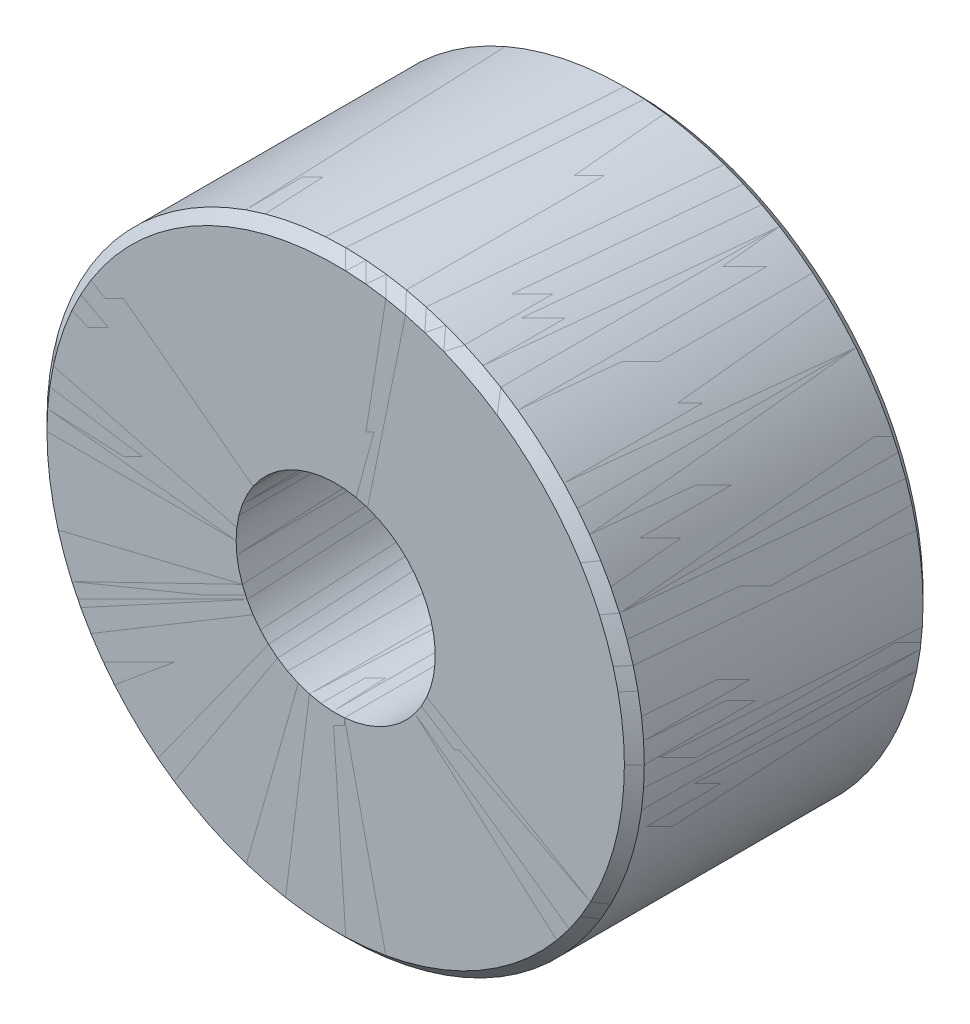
ISO-10303-21;
HEADER;
FILE_DESCRIPTION(('STEP AP214'),'2;1');
FILE_NAME('part.step','',(''),(''),'','','');
FILE_SCHEMA(('AUTOMOTIVE_DESIGN { 1 0 10303 214 1 1 1 1 }'));
ENDSEC;
DATA;
#1=APPLICATION_CONTEXT('core data for automotive mechanical design processes');
#2=APPLICATION_PROTOCOL_DEFINITION('international standard','automotive_design',2000,#1);
#3=PRODUCT_CONTEXT('',#1,'mechanical');
#4=PRODUCT('Part','Part','',(#3));
#5=PRODUCT_RELATED_PRODUCT_CATEGORY('part','',(#4));
#6=PRODUCT_DEFINITION_FORMATION('','',#4);
#7=PRODUCT_DEFINITION_CONTEXT('part definition',#1,'design');
#8=PRODUCT_DEFINITION('design','',#6,#7);
#9=PRODUCT_DEFINITION_SHAPE('','',#8);
#10=(LENGTH_UNIT() NAMED_UNIT(*) SI_UNIT(.MILLI.,.METRE.));
#11=(NAMED_UNIT(*) PLANE_ANGLE_UNIT() SI_UNIT($,.RADIAN.));
#12=(NAMED_UNIT(*) SI_UNIT($,.STERADIAN.) SOLID_ANGLE_UNIT());
#13=UNCERTAINTY_MEASURE_WITH_UNIT(LENGTH_MEASURE(1.E-05),#10,'distance_accuracy_value','');
#14=(GEOMETRIC_REPRESENTATION_CONTEXT(3) GLOBAL_UNCERTAINTY_ASSIGNED_CONTEXT((#13)) GLOBAL_UNIT_ASSIGNED_CONTEXT((#10,
#11,#12)) REPRESENTATION_CONTEXT('',''));
#15=CARTESIAN_POINT('',(0.,0.,0.));
#16=DIRECTION('',(0.,0.,1.));
#17=DIRECTION('',(1.,0.,0.));
#18=AXIS2_PLACEMENT_3D('',#15,#16,#17);
#19=CARTESIAN_POINT('',(0.,0.,-14.5));
#20=DIRECTION('',(0.,0.,1.));
#21=DIRECTION('',(1.,0.,0.));
#22=AXIS2_PLACEMENT_3D('',#19,#20,#21);
#23=CYLINDRICAL_SURFACE('',#22,15.);
#24=CARTESIAN_POINT('',(0.,0.,-14.5));
#25=DIRECTION('',(0.,0.,1.));
#26=DIRECTION('',(1.,0.,0.));
#27=AXIS2_PLACEMENT_3D('',#24,#25,#26);
#28=CIRCLE('',#27,15.);
#29=CARTESIAN_POINT('',(15.,0.,-14.5));
#30=VERTEX_POINT('',#29);
#31=EDGE_CURVE('P0_E362',#30,#30,#28,.T.);
#32=ORIENTED_EDGE('',*,*,#31,.T.);
#33=EDGE_LOOP('',(#32));
#34=FACE_BOUND('',#33,.T.);
#35=CARTESIAN_POINT('',(0.,0.,-0.5));
#36=DIRECTION('',(0.,0.,1.));
#37=DIRECTION('',(1.,0.,0.));
#38=AXIS2_PLACEMENT_3D('',#35,#36,#37);
#39=CIRCLE('',#38,15.);
#40=CARTESIAN_POINT('',(15.,0.,-0.5));
#41=VERTEX_POINT('',#40);
#42=EDGE_CURVE('P0_E371',#41,#41,#39,.F.);
#43=ORIENTED_EDGE('',*,*,#42,.T.);
#44=EDGE_LOOP('',(#43));
#45=FACE_BOUND('',#44,.T.);
#46=ADVANCED_FACE('P0_F346',(#34,#45),#23,.T.);
#47=CARTESIAN_POINT('',(0.,0.,-0.5));
#48=DIRECTION('',(0.,0.,-1.));
#49=DIRECTION('',(-1.,0.,0.));
#50=AXIS2_PLACEMENT_3D('',#47,#48,#49);
#51=CONICAL_SURFACE('',#50,15.,0.785398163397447);
#52=ORIENTED_EDGE('',*,*,#42,.F.);
#53=EDGE_LOOP('',(#52));
#54=FACE_BOUND('',#53,.T.);
#55=CARTESIAN_POINT('',(0.,0.,0.));
#56=DIRECTION('',(0.,0.,-1.));
#57=DIRECTION('',(-1.,0.,0.));
#58=AXIS2_PLACEMENT_3D('',#55,#56,#57);
#59=CIRCLE('',#58,14.5);
#60=CARTESIAN_POINT('',(-14.5,0.,0.));
#61=VERTEX_POINT('',#60);
#62=EDGE_CURVE('P0_E350',#61,#61,#59,.F.);
#63=ORIENTED_EDGE('',*,*,#62,.F.);
#64=EDGE_LOOP('',(#63));
#65=FACE_BOUND('',#64,.T.);
#66=ADVANCED_FACE('P0_F378',(#54,#65),#51,.T.);
#67=CARTESIAN_POINT('',(0.,0.,-15.));
#68=DIRECTION('',(0.,0.,1.));
#69=DIRECTION('',(0.,-1.,0.));
#70=AXIS2_PLACEMENT_3D('',#67,#68,#69);
#71=CONICAL_SURFACE('',#70,14.5,0.785398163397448);
#72=CARTESIAN_POINT('',(0.,0.,-15.));
#73=DIRECTION('',(0.,0.,1.));
#74=DIRECTION('',(0.,-1.,0.));
#75=AXIS2_PLACEMENT_3D('',#72,#73,#74);
#76=CIRCLE('',#75,14.5);
#77=CARTESIAN_POINT('',(0.,-14.5,-15.));
#78=VERTEX_POINT('',#77);
#79=EDGE_CURVE('P0_E359',#78,#78,#76,.F.);
#80=ORIENTED_EDGE('',*,*,#79,.F.);
#81=EDGE_LOOP('',(#80));
#82=FACE_BOUND('',#81,.T.);
#83=ORIENTED_EDGE('',*,*,#31,.F.);
#84=EDGE_LOOP('',(#83));
#85=FACE_BOUND('',#84,.T.);
#86=ADVANCED_FACE('P0_F381',(#82,#85),#71,.T.);
#87=CARTESIAN_POINT('',(-14.5,-14.5,0.));
#88=DIRECTION('',(0.,0.,1.));
#89=DIRECTION('',(1.,0.,0.));
#90=AXIS2_PLACEMENT_3D('',#87,#88,#89);
#91=PLANE('',#90);
#92=CARTESIAN_POINT('',(0.,0.,0.));
#93=DIRECTION('',(0.,0.,-1.));
#94=DIRECTION('',(-1.,0.,0.));
#95=AXIS2_PLACEMENT_3D('',#92,#93,#94);
#96=CIRCLE('',#95,5.);
#97=CARTESIAN_POINT('',(-5.,0.,0.));
#98=VERTEX_POINT('',#97);
#99=EDGE_CURVE('P0_E354',#98,#98,#96,.F.);
#100=ORIENTED_EDGE('',*,*,#99,.F.);
#101=EDGE_LOOP('',(#100));
#102=FACE_BOUND('',#101,.T.);
#103=ORIENTED_EDGE('',*,*,#62,.T.);
#104=EDGE_LOOP('',(#103));
#105=FACE_BOUND('',#104,.T.);
#106=ADVANCED_FACE('P0_F387',(#102,#105),#91,.T.);
#107=CARTESIAN_POINT('',(14.5,-14.5,-15.));
#108=DIRECTION('',(0.,0.,-1.));
#109=DIRECTION('',(-1.,0.,0.));
#110=AXIS2_PLACEMENT_3D('',#107,#108,#109);
#111=PLANE('',#110);
#112=CARTESIAN_POINT('',(0.,0.,-15.));
#113=DIRECTION('',(0.,0.,-1.));
#114=DIRECTION('',(-1.,0.,0.));
#115=AXIS2_PLACEMENT_3D('',#112,#113,#114);
#116=CIRCLE('',#115,5.);
#117=CARTESIAN_POINT('',(-5.,0.,-15.));
#118=VERTEX_POINT('',#117);
#119=EDGE_CURVE('P0_E10',#118,#118,#116,.T.);
#120=ORIENTED_EDGE('',*,*,#119,.F.);
#121=EDGE_LOOP('',(#120));
#122=FACE_BOUND('',#121,.T.);
#123=ORIENTED_EDGE('',*,*,#79,.T.);
#124=EDGE_LOOP('',(#123));
#125=FACE_BOUND('',#124,.T.);
#126=ADVANCED_FACE('P0_F348',(#122,#125),#111,.T.);
#127=CARTESIAN_POINT('',(0.,0.,0.));
#128=DIRECTION('',(0.,0.,-1.));
#129=DIRECTION('',(-1.,0.,0.));
#130=AXIS2_PLACEMENT_3D('',#127,#128,#129);
#131=CYLINDRICAL_SURFACE('',#130,5.);
#132=ORIENTED_EDGE('',*,*,#119,.T.);
#133=EDGE_LOOP('',(#132));
#134=FACE_BOUND('',#133,.T.);
#135=ORIENTED_EDGE('',*,*,#99,.T.);
#136=EDGE_LOOP('',(#135));
#137=FACE_BOUND('',#136,.T.);
#138=ADVANCED_FACE('P0_F392',(#134,#137),#131,.F.);
#139=CLOSED_SHELL('',(#46,#66,#86,#106,#126,#138));
#140=MANIFOLD_SOLID_BREP('P0_B2',#139);
#141=CARTESIAN_POINT('',(0.,0.,-14.5));
#142=DIRECTION('',(0.,0.,1.));
#143=DIRECTION('',(1.,0.,0.));
#144=AXIS2_PLACEMENT_3D('',#141,#142,#143);
#145=CYLINDRICAL_SURFACE('',#144,15.);
#146=CARTESIAN_POINT('',(0.,0.,-14.5));
#147=DIRECTION('',(0.,0.,1.));
#148=DIRECTION('',(1.,0.,0.));
#149=AXIS2_PLACEMENT_3D('',#146,#147,#148);
#150=CIRCLE('',#149,15.);
#151=CARTESIAN_POINT('',(15.,0.,-14.5));
#152=VERTEX_POINT('',#151);
#153=EDGE_CURVE('P1_E29',#152,#152,#150,.T.);
#154=ORIENTED_EDGE('',*,*,#153,.T.);
#155=EDGE_LOOP('',(#154));
#156=FACE_BOUND('',#155,.T.);
#157=CARTESIAN_POINT('',(0.,0.,-0.5));
#158=DIRECTION('',(0.,0.,1.));
#159=DIRECTION('',(1.,0.,0.));
#160=AXIS2_PLACEMENT_3D('',#157,#158,#159);
#161=CIRCLE('',#160,15.);
#162=CARTESIAN_POINT('',(15.,0.,-0.5));
#163=VERTEX_POINT('',#162);
#164=EDGE_CURVE('P1_E38',#163,#163,#161,.F.);
#165=ORIENTED_EDGE('',*,*,#164,.T.);
#166=EDGE_LOOP('',(#165));
#167=FACE_BOUND('',#166,.T.);
#168=ADVANCED_FACE('P1_F13',(#156,#167),#145,.T.);
#169=CARTESIAN_POINT('',(0.,0.,-0.5));
#170=DIRECTION('',(0.,0.,-1.));
#171=DIRECTION('',(-1.,0.,0.));
#172=AXIS2_PLACEMENT_3D('',#169,#170,#171);
#173=CONICAL_SURFACE('',#172,15.,0.785398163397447);
#174=ORIENTED_EDGE('',*,*,#164,.F.);
#175=EDGE_LOOP('',(#174));
#176=FACE_BOUND('',#175,.T.);
#177=CARTESIAN_POINT('',(0.,0.,0.));
#178=DIRECTION('',(0.,0.,-1.));
#179=DIRECTION('',(-1.,0.,0.));
#180=AXIS2_PLACEMENT_3D('',#177,#178,#179);
#181=CIRCLE('',#180,14.5);
#182=CARTESIAN_POINT('',(-14.5,0.,0.));
#183=VERTEX_POINT('',#182);
#184=EDGE_CURVE('P1_E17',#183,#183,#181,.F.);
#185=ORIENTED_EDGE('',*,*,#184,.F.);
#186=EDGE_LOOP('',(#185));
#187=FACE_BOUND('',#186,.T.);
#188=ADVANCED_FACE('P1_F45',(#176,#187),#173,.T.);
#189=CARTESIAN_POINT('',(0.,0.,-15.));
#190=DIRECTION('',(0.,0.,1.));
#191=DIRECTION('',(0.,-1.,0.));
#192=AXIS2_PLACEMENT_3D('',#189,#190,#191);
#193=CONICAL_SURFACE('',#192,14.5,0.785398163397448);
#194=CARTESIAN_POINT('',(0.,0.,-15.));
#195=DIRECTION('',(0.,0.,1.));
#196=DIRECTION('',(0.,-1.,0.));
#197=AXIS2_PLACEMENT_3D('',#194,#195,#196);
#198=CIRCLE('',#197,14.5);
#199=CARTESIAN_POINT('',(0.,-14.5,-15.));
#200=VERTEX_POINT('',#199);
#201=EDGE_CURVE('P1_E26',#200,#200,#198,.F.);
#202=ORIENTED_EDGE('',*,*,#201,.F.);
#203=EDGE_LOOP('',(#202));
#204=FACE_BOUND('',#203,.T.);
#205=ORIENTED_EDGE('',*,*,#153,.F.);
#206=EDGE_LOOP('',(#205));
#207=FACE_BOUND('',#206,.T.);
#208=ADVANCED_FACE('P1_F48',(#204,#207),#193,.T.);
#209=CARTESIAN_POINT('',(-14.5,-14.5,0.));
#210=DIRECTION('',(0.,0.,1.));
#211=DIRECTION('',(1.,0.,0.));
#212=AXIS2_PLACEMENT_3D('',#209,#210,#211);
#213=PLANE('',#212);
#214=CARTESIAN_POINT('',(0.,0.,0.));
#215=DIRECTION('',(0.,0.,-1.));
#216=DIRECTION('',(-1.,0.,0.));
#217=AXIS2_PLACEMENT_3D('',#214,#215,#216);
#218=CIRCLE('',#217,5.);
#219=CARTESIAN_POINT('',(-5.,0.,0.));
#220=VERTEX_POINT('',#219);
#221=EDGE_CURVE('P1_E21',#220,#220,#218,.F.);
#222=ORIENTED_EDGE('',*,*,#221,.F.);
#223=EDGE_LOOP('',(#222));
#224=FACE_BOUND('',#223,.T.);
#225=ORIENTED_EDGE('',*,*,#184,.T.);
#226=EDGE_LOOP('',(#225));
#227=FACE_BOUND('',#226,.T.);
#228=ADVANCED_FACE('P1_F53',(#224,#227),#213,.T.);
#229=CARTESIAN_POINT('',(14.5,-14.5,-15.));
#230=DIRECTION('',(0.,0.,-1.));
#231=DIRECTION('',(-1.,0.,0.));
#232=AXIS2_PLACEMENT_3D('',#229,#230,#231);
#233=PLANE('',#232);
#234=CARTESIAN_POINT('',(0.,0.,-15.));
#235=DIRECTION('',(0.,0.,-1.));
#236=DIRECTION('',(-1.,0.,0.));
#237=AXIS2_PLACEMENT_3D('',#234,#235,#236);
#238=CIRCLE('',#237,5.);
#239=CARTESIAN_POINT('',(-5.,0.,-15.));
#240=VERTEX_POINT('',#239);
#241=EDGE_CURVE('P1_E9',#240,#240,#238,.T.);
#242=ORIENTED_EDGE('',*,*,#241,.F.);
#243=EDGE_LOOP('',(#242));
#244=FACE_BOUND('',#243,.T.);
#245=ORIENTED_EDGE('',*,*,#201,.T.);
#246=EDGE_LOOP('',(#245));
#247=FACE_BOUND('',#246,.T.);
#248=ADVANCED_FACE('P1_F15',(#244,#247),#233,.T.);
#249=CARTESIAN_POINT('',(0.,0.,0.));
#250=DIRECTION('',(0.,0.,-1.));
#251=DIRECTION('',(-1.,0.,0.));
#252=AXIS2_PLACEMENT_3D('',#249,#250,#251);
#253=CYLINDRICAL_SURFACE('',#252,5.);
#254=ORIENTED_EDGE('',*,*,#241,.T.);
#255=EDGE_LOOP('',(#254));
#256=FACE_BOUND('',#255,.T.);
#257=ORIENTED_EDGE('',*,*,#221,.T.);
#258=EDGE_LOOP('',(#257));
#259=FACE_BOUND('',#258,.T.);
#260=ADVANCED_FACE('P1_F58',(#256,#259),#253,.F.);
#261=CLOSED_SHELL('',(#168,#188,#208,#228,#248,#260));
#262=MANIFOLD_SOLID_BREP('P1_B1',#261);
#263=ADVANCED_BREP_SHAPE_REPRESENTATION('',(#18,#140,#262),#14);
#264=SHAPE_DEFINITION_REPRESENTATION(#9,#263);
ENDSEC;
END-ISO-10303-21;
